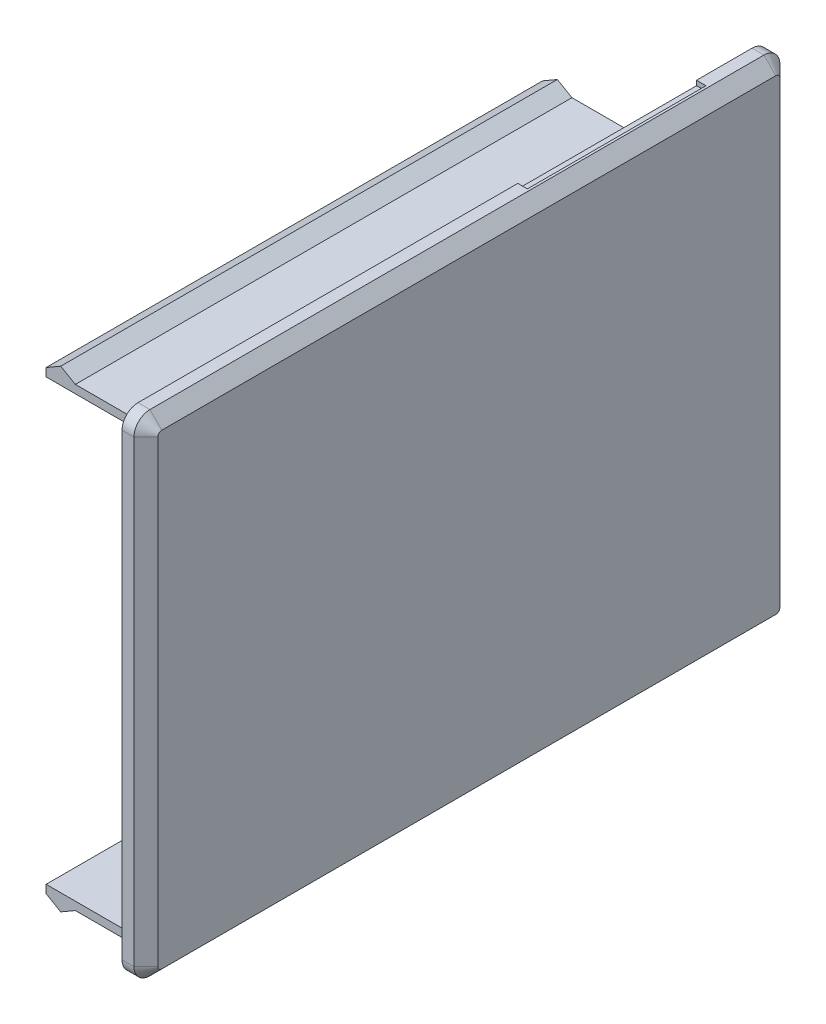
from build123d import *

# Parameters (mm, degrees)
SKETCH2_W           = 68.86
SKETCH2_H           = 52.28
BOSS_EXTRUDE1_DEPTH = 2.54
SKETCH3_W           = 65.639999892
SKETCH3_H           = 48.58
SKETCH3_W_2         = 63.899999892
SKETCH3_H_2         = 46.84
EXTRUDE_THIN1_DEPTH = 0.762
BOSS_EXTRUDE2_DEPTH = 65.639999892
FILLET1_R           = 1.7
CUT_EXTRUDE1_START  = -7.62
SKETCH5_W           = 1.016
SKETCH5_H           = 0.508
CUT_EXTRUDE1_DEPTH  = 19.05
CHAMFER1_SIZE       = 1.27
SKETCH6_W           = 9.232419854
SKETCH6_H           = 12.7
CUT_EXTRUDE2_DEPTH  = 2.72


with BuildPart() as part:
    # Sketch2 → Boss-Extrude1 (new body)
    with BuildSketch(Plane(origin=(0, 0, 0), x_dir=(0, 0, -1), z_dir=(1, 0, 0))):
        with Locations((34.43, 26.14)):
            Rectangle(SKETCH2_W, SKETCH2_H)
    extrude(amount=BOSS_EXTRUDE1_DEPTH)

    # Sketch3 → Extrude-Thin1 (add)
    with BuildSketch(Plane.ZY):
        with Locations((-34.719999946, 26.14)):
            Rectangle(SKETCH3_W, SKETCH3_H)
        with Locations((-34.719999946, 26.14)):
            Rectangle(SKETCH3_W_2, SKETCH3_H_2, mode=Mode.SUBTRACT)
    extrude(amount=EXTRUDE_THIN1_DEPTH)

    # Sketch4 → Boss-Extrude2 (add)
    with BuildSketch(Plane.XY.offset(-1.9)):
        Polygon((-0.762, 50.43), (-6.876689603, 50.43), (-8.435554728, 51.3300112), (-9.994419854, 50.43), (-9.994419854, 49.56), (-0.762, 49.56), align=None)
    boss_extrude2 = extrude(amount=-BOSS_EXTRUDE2_DEPTH)

    # Fillet1
    fillet1_edges = [part.edges().sort_by_distance(p)[0] for p in [
        (1.27, 52.28, 0),
        (1.27, 52.28, -68.86),
        (1.27, 0, -68.86),
        (1.27, 0, 0),
    ]]
    fillet(fillet1_edges, radius=FILLET1_R)

    # Sketch5 → Cut-Extrude1 (cut)
    with BuildSketch(Plane(origin=(0, 0, -68.86), x_dir=(-1, 0, 0), z_dir=(0, 0, -1)).offset(CUT_EXTRUDE1_START)):
        with Locations((-0.508, 52.026)):
            Rectangle(SKETCH5_W, SKETCH5_H)
    cut_extrude1 = extrude(amount=-CUT_EXTRUDE1_DEPTH, mode=Mode.SUBTRACT)

    # Mirror3: Boss-Extrude2, Cut-Extrude1 across plane
    add(boss_extrude2.mirror(Plane.ZX.offset(26.14)))
    add(cut_extrude1.mirror(Plane.ZX.offset(26.14)), mode=Mode.SUBTRACT)

    # Chamfer1
    chamfer1_edges = [part.edges().sort_by_distance(p)[0] for p in [
        (2.54, 26.14, 0),
        (2.54, 52.28, -34.43),
        (2.54, 0, -34.43),
        (2.54, 26.14, -68.86),
        (2.54, 0.497918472, -68.362081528),
        (2.54, 51.782081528, -68.362081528),
        (2.54, 0.497918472, -0.497918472),
        (2.54, 51.782081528, -0.497918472),
    ]]
    chamfer(chamfer1_edges, length=CHAMFER1_SIZE)

    # Sketch6 → Cut-Extrude2 (cut)
    with BuildSketch(Plane(origin=(0, 52.28, 0), x_dir=(1, 0, 0), z_dir=(0, 1, 0))):
        with Locations((-5.378209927, 61.189999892)):
            Rectangle(SKETCH6_W, SKETCH6_H)
    extrude(amount=-CUT_EXTRUDE2_DEPTH, mode=Mode.SUBTRACT)


solid = part.part
